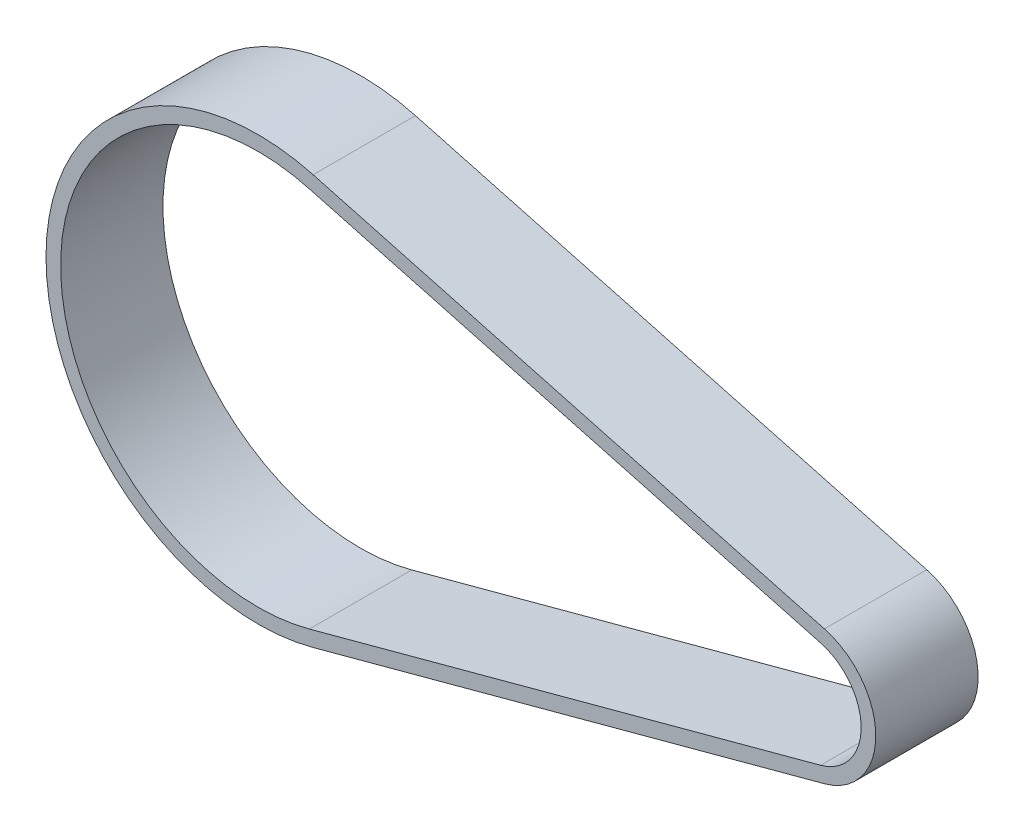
ISO-10303-21;
HEADER;
FILE_DESCRIPTION(('STEP AP214'),'2;1');
FILE_NAME('part.step','',(''),(''),'','','');
FILE_SCHEMA(('AUTOMOTIVE_DESIGN { 1 0 10303 214 1 1 1 1 }'));
ENDSEC;
DATA;
#1=APPLICATION_CONTEXT('core data for automotive mechanical design processes');
#2=APPLICATION_PROTOCOL_DEFINITION('international standard','automotive_design',2000,#1);
#3=PRODUCT_CONTEXT('',#1,'mechanical');
#4=PRODUCT('Part','Part','',(#3));
#5=PRODUCT_RELATED_PRODUCT_CATEGORY('part','',(#4));
#6=PRODUCT_DEFINITION_FORMATION('','',#4);
#7=PRODUCT_DEFINITION_CONTEXT('part definition',#1,'design');
#8=PRODUCT_DEFINITION('design','',#6,#7);
#9=PRODUCT_DEFINITION_SHAPE('','',#8);
#10=(LENGTH_UNIT() NAMED_UNIT(*) SI_UNIT(.MILLI.,.METRE.));
#11=(NAMED_UNIT(*) PLANE_ANGLE_UNIT() SI_UNIT($,.RADIAN.));
#12=(NAMED_UNIT(*) SI_UNIT($,.STERADIAN.) SOLID_ANGLE_UNIT());
#13=UNCERTAINTY_MEASURE_WITH_UNIT(LENGTH_MEASURE(1.E-05),#10,'distance_accuracy_value','');
#14=(GEOMETRIC_REPRESENTATION_CONTEXT(3) GLOBAL_UNCERTAINTY_ASSIGNED_CONTEXT((#13)) GLOBAL_UNIT_ASSIGNED_CONTEXT((#10,
#11,#12)) REPRESENTATION_CONTEXT('',''));
#15=CARTESIAN_POINT('',(0.,0.,0.));
#16=DIRECTION('',(0.,0.,1.));
#17=DIRECTION('',(1.,0.,0.));
#18=AXIS2_PLACEMENT_3D('',#15,#16,#17);
#19=CARTESIAN_POINT('',(0.,0.,14.));
#20=DIRECTION('',(0.,0.,1.));
#21=DIRECTION('',(1.,0.,0.));
#22=AXIS2_PLACEMENT_3D('',#19,#20,#21);
#23=PLANE('',#22);
#24=CARTESIAN_POINT('',(0.,0.,14.));
#25=DIRECTION('',(0.,0.,1.));
#26=DIRECTION('',(1.,0.,0.));
#27=AXIS2_PLACEMENT_3D('',#24,#25,#26);
#28=CIRCLE('',#27,29.);
#29=CARTESIAN_POINT('',(7.54,28.0026498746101,14.));
#30=VERTEX_POINT('',#29);
#31=CARTESIAN_POINT('',(7.54,-28.0026498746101,14.));
#32=VERTEX_POINT('',#31);
#33=EDGE_CURVE('E156',#30,#32,#28,.T.);
#34=ORIENTED_EDGE('',*,*,#33,.T.);
#35=DIRECTION('',(0.965608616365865,0.26,0.));
#36=VECTOR('',#35,1.);
#37=CARTESIAN_POINT('',(7.54,-28.0026498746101,14.));
#38=LINE('',#37,#36);
#39=CARTESIAN_POINT('',(77.47,-9.17328185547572,14.));
#40=VERTEX_POINT('',#39);
#41=EDGE_CURVE('E159',#32,#40,#38,.T.);
#42=ORIENTED_EDGE('',*,*,#41,.T.);
#43=CARTESIAN_POINT('',(75.,0.,14.));
#44=DIRECTION('',(0.,0.,1.));
#45=DIRECTION('',(1.,0.,0.));
#46=AXIS2_PLACEMENT_3D('',#43,#44,#45);
#47=CIRCLE('',#46,9.50000000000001);
#48=CARTESIAN_POINT('',(77.47,9.17328185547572,14.));
#49=VERTEX_POINT('',#48);
#50=EDGE_CURVE('E162',#40,#49,#47,.T.);
#51=ORIENTED_EDGE('',*,*,#50,.T.);
#52=DIRECTION('',(-0.965608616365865,0.26,0.));
#53=VECTOR('',#52,1.);
#54=CARTESIAN_POINT('',(7.54,28.0026498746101,14.));
#55=LINE('',#54,#53);
#56=EDGE_CURVE('E164',#49,#30,#55,.T.);
#57=ORIENTED_EDGE('',*,*,#56,.T.);
#58=EDGE_LOOP('',(#34,#42,#51,#57));
#59=FACE_BOUND('',#58,.T.);
#60=DIRECTION('',(0.965608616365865,0.26,0.));
#61=VECTOR('',#60,1.);
#62=CARTESIAN_POINT('',(7.02,-26.0714326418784,14.));
#63=LINE('',#62,#61);
#64=CARTESIAN_POINT('',(7.02,-26.0714326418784,14.));
#65=VERTEX_POINT('',#64);
#66=CARTESIAN_POINT('',(76.95,-7.242064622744,14.));
#67=VERTEX_POINT('',#66);
#68=EDGE_CURVE('E128',#65,#67,#63,.T.);
#69=ORIENTED_EDGE('',*,*,#68,.F.);
#70=CARTESIAN_POINT('',(0.,0.,14.));
#71=DIRECTION('',(0.,0.,1.));
#72=DIRECTION('',(1.,0.,0.));
#73=AXIS2_PLACEMENT_3D('',#70,#71,#72);
#74=CIRCLE('',#73,27.);
#75=CARTESIAN_POINT('',(7.02,26.0714326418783,14.));
#76=VERTEX_POINT('',#75);
#77=EDGE_CURVE('E120',#76,#65,#74,.T.);
#78=ORIENTED_EDGE('',*,*,#77,.F.);
#79=DIRECTION('',(-0.965608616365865,0.26,0.));
#80=VECTOR('',#79,1.);
#81=CARTESIAN_POINT('',(7.02,26.0714326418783,14.));
#82=LINE('',#81,#80);
#83=CARTESIAN_POINT('',(76.95,7.242064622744,14.));
#84=VERTEX_POINT('',#83);
#85=EDGE_CURVE('E142',#84,#76,#82,.T.);
#86=ORIENTED_EDGE('',*,*,#85,.F.);
#87=CARTESIAN_POINT('',(75.,0.,14.));
#88=DIRECTION('',(0.,0.,1.));
#89=DIRECTION('',(1.,0.,0.));
#90=AXIS2_PLACEMENT_3D('',#87,#88,#89);
#91=CIRCLE('',#90,7.5);
#92=EDGE_CURVE('E140',#67,#84,#91,.T.);
#93=ORIENTED_EDGE('',*,*,#92,.F.);
#94=EDGE_LOOP('',(#69,#78,#86,#93));
#95=FACE_BOUND('',#94,.T.);
#96=ADVANCED_FACE('F55',(#59,#95),#23,.T.);
#97=CARTESIAN_POINT('',(0.,0.,0.));
#98=DIRECTION('',(0.,0.,1.));
#99=DIRECTION('',(1.,0.,0.));
#100=AXIS2_PLACEMENT_3D('',#97,#98,#99);
#101=PLANE('',#100);
#102=CARTESIAN_POINT('',(0.,0.,0.));
#103=DIRECTION('',(0.,0.,1.));
#104=DIRECTION('',(1.,0.,0.));
#105=AXIS2_PLACEMENT_3D('',#102,#103,#104);
#106=CIRCLE('',#105,29.);
#107=CARTESIAN_POINT('',(7.54,28.0026498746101,0.));
#108=VERTEX_POINT('',#107);
#109=CARTESIAN_POINT('',(7.54,-28.0026498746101,0.));
#110=VERTEX_POINT('',#109);
#111=EDGE_CURVE('E136',#108,#110,#106,.T.);
#112=ORIENTED_EDGE('',*,*,#111,.F.);
#113=DIRECTION('',(-0.965608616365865,0.26,0.));
#114=VECTOR('',#113,1.);
#115=CARTESIAN_POINT('',(7.54,28.0026498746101,0.));
#116=LINE('',#115,#114);
#117=CARTESIAN_POINT('',(77.47,9.17328185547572,0.));
#118=VERTEX_POINT('',#117);
#119=EDGE_CURVE('E160',#118,#108,#116,.T.);
#120=ORIENTED_EDGE('',*,*,#119,.F.);
#121=CARTESIAN_POINT('',(75.,0.,0.));
#122=DIRECTION('',(0.,0.,1.));
#123=DIRECTION('',(1.,0.,0.));
#124=AXIS2_PLACEMENT_3D('',#121,#122,#123);
#125=CIRCLE('',#124,9.50000000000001);
#126=CARTESIAN_POINT('',(77.47,-9.17328185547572,0.));
#127=VERTEX_POINT('',#126);
#128=EDGE_CURVE('E171',#127,#118,#125,.T.);
#129=ORIENTED_EDGE('',*,*,#128,.F.);
#130=DIRECTION('',(0.965608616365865,0.26,0.));
#131=VECTOR('',#130,1.);
#132=CARTESIAN_POINT('',(7.54,-28.0026498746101,0.));
#133=LINE('',#132,#131);
#134=EDGE_CURVE('E169',#110,#127,#133,.T.);
#135=ORIENTED_EDGE('',*,*,#134,.F.);
#136=EDGE_LOOP('',(#112,#120,#129,#135));
#137=FACE_BOUND('',#136,.T.);
#138=CARTESIAN_POINT('',(0.,0.,0.));
#139=DIRECTION('',(0.,0.,1.));
#140=DIRECTION('',(1.,0.,0.));
#141=AXIS2_PLACEMENT_3D('',#138,#139,#140);
#142=CIRCLE('',#141,27.);
#143=CARTESIAN_POINT('',(7.02,26.0714326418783,0.));
#144=VERTEX_POINT('',#143);
#145=CARTESIAN_POINT('',(7.02,-26.0714326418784,0.));
#146=VERTEX_POINT('',#145);
#147=EDGE_CURVE('E78',#144,#146,#142,.T.);
#148=ORIENTED_EDGE('',*,*,#147,.T.);
#149=DIRECTION('',(0.965608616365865,0.26,0.));
#150=VECTOR('',#149,1.);
#151=CARTESIAN_POINT('',(7.02,-26.0714326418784,0.));
#152=LINE('',#151,#150);
#153=CARTESIAN_POINT('',(76.95,-7.242064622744,0.));
#154=VERTEX_POINT('',#153);
#155=EDGE_CURVE('E135',#146,#154,#152,.T.);
#156=ORIENTED_EDGE('',*,*,#155,.T.);
#157=CARTESIAN_POINT('',(75.,0.,0.));
#158=DIRECTION('',(0.,0.,1.));
#159=DIRECTION('',(1.,0.,0.));
#160=AXIS2_PLACEMENT_3D('',#157,#158,#159);
#161=CIRCLE('',#160,7.5);
#162=CARTESIAN_POINT('',(76.95,7.24206462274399,0.));
#163=VERTEX_POINT('',#162);
#164=EDGE_CURVE('E148',#154,#163,#161,.T.);
#165=ORIENTED_EDGE('',*,*,#164,.T.);
#166=DIRECTION('',(-0.965608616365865,0.26,0.));
#167=VECTOR('',#166,1.);
#168=CARTESIAN_POINT('',(7.02,26.0714326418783,0.));
#169=LINE('',#168,#167);
#170=EDGE_CURVE('E129',#163,#144,#169,.T.);
#171=ORIENTED_EDGE('',*,*,#170,.T.);
#172=EDGE_LOOP('',(#148,#156,#165,#171));
#173=FACE_BOUND('',#172,.T.);
#174=ADVANCED_FACE('F189',(#137,#173),#101,.F.);
#175=CARTESIAN_POINT('',(0.,0.,14.));
#176=DIRECTION('',(0.,0.,-1.));
#177=DIRECTION('',(-1.,0.,0.));
#178=AXIS2_PLACEMENT_3D('',#175,#176,#177);
#179=CYLINDRICAL_SURFACE('',#178,29.);
#180=ORIENTED_EDGE('',*,*,#111,.T.);
#181=DIRECTION('',(0.,0.,-1.));
#182=VECTOR('',#181,1.);
#183=CARTESIAN_POINT('',(7.54,-28.0026498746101,14.));
#184=LINE('',#183,#182);
#185=EDGE_CURVE('E12',#32,#110,#184,.T.);
#186=ORIENTED_EDGE('',*,*,#185,.F.);
#187=ORIENTED_EDGE('',*,*,#33,.F.);
#188=DIRECTION('',(0.,0.,-1.));
#189=VECTOR('',#188,1.);
#190=CARTESIAN_POINT('',(7.54,28.0026498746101,14.));
#191=LINE('',#190,#189);
#192=EDGE_CURVE('E166',#30,#108,#191,.T.);
#193=ORIENTED_EDGE('',*,*,#192,.T.);
#194=EDGE_LOOP('',(#180,#186,#187,#193));
#195=FACE_BOUND('',#194,.T.);
#196=ADVANCED_FACE('F57',(#195),#179,.T.);
#197=CARTESIAN_POINT('',(7.54,-28.0026498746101,14.));
#198=DIRECTION('',(-0.26,0.965608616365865,0.));
#199=DIRECTION('',(-0.965608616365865,-0.26,0.));
#200=AXIS2_PLACEMENT_3D('',#197,#198,#199);
#201=PLANE('',#200);
#202=ORIENTED_EDGE('',*,*,#134,.T.);
#203=DIRECTION('',(0.,0.,-1.));
#204=VECTOR('',#203,1.);
#205=CARTESIAN_POINT('',(77.47,-9.17328185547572,14.));
#206=LINE('',#205,#204);
#207=EDGE_CURVE('E63',#40,#127,#206,.T.);
#208=ORIENTED_EDGE('',*,*,#207,.F.);
#209=ORIENTED_EDGE('',*,*,#41,.F.);
#210=ORIENTED_EDGE('',*,*,#185,.T.);
#211=EDGE_LOOP('',(#202,#208,#209,#210));
#212=FACE_BOUND('',#211,.T.);
#213=ADVANCED_FACE('F199',(#212),#201,.F.);
#214=CARTESIAN_POINT('',(75.,0.,14.));
#215=DIRECTION('',(0.,0.,-1.));
#216=DIRECTION('',(-1.,0.,0.));
#217=AXIS2_PLACEMENT_3D('',#214,#215,#216);
#218=CYLINDRICAL_SURFACE('',#217,9.50000000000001);
#219=ORIENTED_EDGE('',*,*,#128,.T.);
#220=DIRECTION('',(0.,0.,-1.));
#221=VECTOR('',#220,1.);
#222=CARTESIAN_POINT('',(77.47,9.17328185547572,14.));
#223=LINE('',#222,#221);
#224=EDGE_CURVE('E176',#49,#118,#223,.T.);
#225=ORIENTED_EDGE('',*,*,#224,.F.);
#226=ORIENTED_EDGE('',*,*,#50,.F.);
#227=ORIENTED_EDGE('',*,*,#207,.T.);
#228=EDGE_LOOP('',(#219,#225,#226,#227));
#229=FACE_BOUND('',#228,.T.);
#230=ADVANCED_FACE('F183',(#229),#218,.T.);
#231=CARTESIAN_POINT('',(7.54,28.0026498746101,14.));
#232=DIRECTION('',(-0.26,-0.965608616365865,0.));
#233=DIRECTION('',(0.965608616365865,-0.26,0.));
#234=AXIS2_PLACEMENT_3D('',#231,#232,#233);
#235=PLANE('',#234);
#236=ORIENTED_EDGE('',*,*,#119,.T.);
#237=ORIENTED_EDGE('',*,*,#192,.F.);
#238=ORIENTED_EDGE('',*,*,#56,.F.);
#239=ORIENTED_EDGE('',*,*,#224,.T.);
#240=EDGE_LOOP('',(#236,#237,#238,#239));
#241=FACE_BOUND('',#240,.T.);
#242=ADVANCED_FACE('F193',(#241),#235,.F.);
#243=CARTESIAN_POINT('',(0.,0.,14.));
#244=DIRECTION('',(0.,0.,-1.));
#245=DIRECTION('',(-1.,0.,0.));
#246=AXIS2_PLACEMENT_3D('',#243,#244,#245);
#247=CYLINDRICAL_SURFACE('',#246,27.);
#248=ORIENTED_EDGE('',*,*,#147,.F.);
#249=DIRECTION('',(0.,0.,-1.));
#250=VECTOR('',#249,1.);
#251=CARTESIAN_POINT('',(7.02,26.0714326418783,14.));
#252=LINE('',#251,#250);
#253=EDGE_CURVE('E124',#76,#144,#252,.T.);
#254=ORIENTED_EDGE('',*,*,#253,.F.);
#255=ORIENTED_EDGE('',*,*,#77,.T.);
#256=DIRECTION('',(0.,0.,-1.));
#257=VECTOR('',#256,1.);
#258=CARTESIAN_POINT('',(7.02,-26.0714326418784,14.));
#259=LINE('',#258,#257);
#260=EDGE_CURVE('E123',#65,#146,#259,.T.);
#261=ORIENTED_EDGE('',*,*,#260,.T.);
#262=EDGE_LOOP('',(#248,#254,#255,#261));
#263=FACE_BOUND('',#262,.T.);
#264=ADVANCED_FACE('F122',(#263),#247,.F.);
#265=CARTESIAN_POINT('',(7.02,-26.0714326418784,14.));
#266=DIRECTION('',(-0.26,0.965608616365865,0.));
#267=DIRECTION('',(-0.965608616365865,-0.26,0.));
#268=AXIS2_PLACEMENT_3D('',#265,#266,#267);
#269=PLANE('',#268);
#270=ORIENTED_EDGE('',*,*,#155,.F.);
#271=ORIENTED_EDGE('',*,*,#260,.F.);
#272=ORIENTED_EDGE('',*,*,#68,.T.);
#273=DIRECTION('',(0.,0.,-1.));
#274=VECTOR('',#273,1.);
#275=CARTESIAN_POINT('',(76.95,-7.242064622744,14.));
#276=LINE('',#275,#274);
#277=EDGE_CURVE('E137',#67,#154,#276,.T.);
#278=ORIENTED_EDGE('',*,*,#277,.T.);
#279=EDGE_LOOP('',(#270,#271,#272,#278));
#280=FACE_BOUND('',#279,.T.);
#281=ADVANCED_FACE('F132',(#280),#269,.T.);
#282=CARTESIAN_POINT('',(75.,0.,14.));
#283=DIRECTION('',(0.,0.,-1.));
#284=DIRECTION('',(-1.,0.,0.));
#285=AXIS2_PLACEMENT_3D('',#282,#283,#284);
#286=CYLINDRICAL_SURFACE('',#285,7.5);
#287=ORIENTED_EDGE('',*,*,#164,.F.);
#288=ORIENTED_EDGE('',*,*,#277,.F.);
#289=ORIENTED_EDGE('',*,*,#92,.T.);
#290=DIRECTION('',(0.,0.,-1.));
#291=VECTOR('',#290,1.);
#292=CARTESIAN_POINT('',(76.95,7.24206462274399,14.));
#293=LINE('',#292,#291);
#294=EDGE_CURVE('E70',#84,#163,#293,.T.);
#295=ORIENTED_EDGE('',*,*,#294,.T.);
#296=EDGE_LOOP('',(#287,#288,#289,#295));
#297=FACE_BOUND('',#296,.T.);
#298=ADVANCED_FACE('F222',(#297),#286,.F.);
#299=CARTESIAN_POINT('',(7.02,26.0714326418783,14.));
#300=DIRECTION('',(-0.26,-0.965608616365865,0.));
#301=DIRECTION('',(0.965608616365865,-0.26,0.));
#302=AXIS2_PLACEMENT_3D('',#299,#300,#301);
#303=PLANE('',#302);
#304=ORIENTED_EDGE('',*,*,#170,.F.);
#305=ORIENTED_EDGE('',*,*,#294,.F.);
#306=ORIENTED_EDGE('',*,*,#85,.T.);
#307=ORIENTED_EDGE('',*,*,#253,.T.);
#308=EDGE_LOOP('',(#304,#305,#306,#307));
#309=FACE_BOUND('',#308,.T.);
#310=ADVANCED_FACE('F226',(#309),#303,.T.);
#311=CLOSED_SHELL('',(#96,#174,#196,#213,#230,#242,#264,#281,#298,#310));
#312=MANIFOLD_SOLID_BREP('B2',#311);
#313=ADVANCED_BREP_SHAPE_REPRESENTATION('',(#18,#312),#14);
#314=SHAPE_DEFINITION_REPRESENTATION(#9,#313);
ENDSEC;
END-ISO-10303-21;
